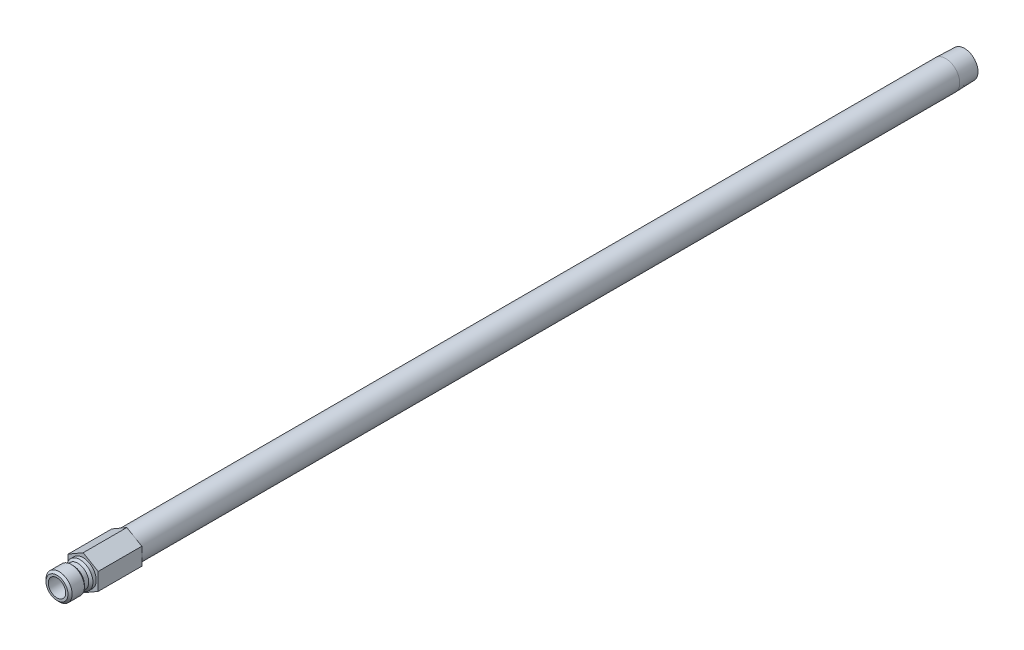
from build123d import *

# Parameters (mm, degrees)
SKETCH2_R           = 2.38125
BOSS_EXTRUDE1_DEPTH = 15.875


with BuildPart() as part:
    # Sketch1 → Revolve1 (revolve)
    with BuildSketch(Plane(origin=(0, 0, 0), x_dir=(0, 0, -1), z_dir=(1, 0, 0))):
        Polygon((-9.525, 3.175), (-9.525, 4.0005), (-8.763, 4.7625), (-4.318, 4.7625), (-3.556, 4.0005), (-1.9685, 4.0005), (-1.2065, 4.7625), (0, 4.7625), (0, 5.1435), (313.817, 5.1435), (320.675, 4.929188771), (320.675, 2.38125), (0.127, 2.38125), (0.127, 3.175), align=None)
    revolve(axis=Axis((0, 0, 0), (0, 0, 1)))

    # Sketch2 → Boss-Extrude1 (add)
    with BuildSketch(Plane.XY):
        Polygon((-5.461, 3.15290982), (-5.461, -3.15290982), (0, -6.30581964), (5.461, -3.15290982), (5.461, 3.15290982), (0, 6.30581964), align=None)
        with Locations(Location((0, 0, 0), (0, 0, 90))):
            Circle(SKETCH2_R, mode=Mode.SUBTRACT)
    extrude(amount=-BOSS_EXTRUDE1_DEPTH)


solid = part.part
